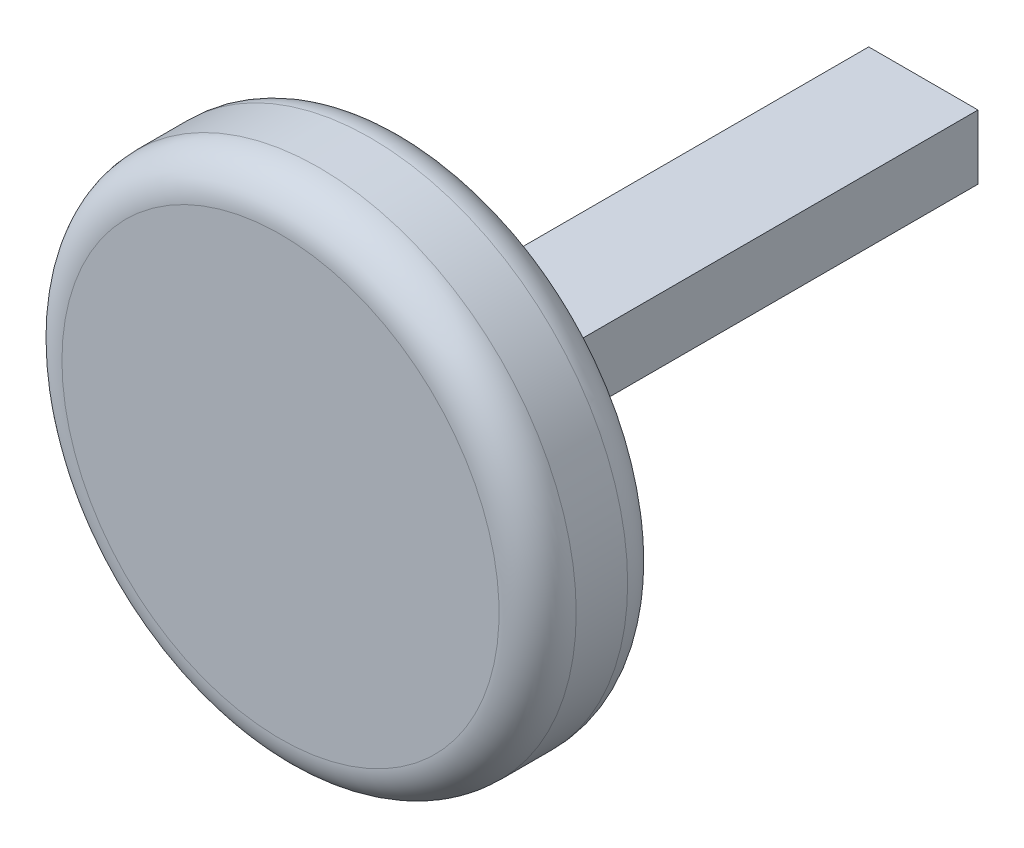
ISO-10303-21;
HEADER;
FILE_DESCRIPTION(('STEP AP214'),'2;1');
FILE_NAME('part.step','',(''),(''),'','','');
FILE_SCHEMA(('AUTOMOTIVE_DESIGN { 1 0 10303 214 1 1 1 1 }'));
ENDSEC;
DATA;
#1=APPLICATION_CONTEXT('core data for automotive mechanical design processes');
#2=APPLICATION_PROTOCOL_DEFINITION('international standard','automotive_design',2000,#1);
#3=PRODUCT_CONTEXT('',#1,'mechanical');
#4=PRODUCT('Part','Part','',(#3));
#5=PRODUCT_RELATED_PRODUCT_CATEGORY('part','',(#4));
#6=PRODUCT_DEFINITION_FORMATION('','',#4);
#7=PRODUCT_DEFINITION_CONTEXT('part definition',#1,'design');
#8=PRODUCT_DEFINITION('design','',#6,#7);
#9=PRODUCT_DEFINITION_SHAPE('','',#8);
#10=(LENGTH_UNIT() NAMED_UNIT(*) SI_UNIT(.MILLI.,.METRE.));
#11=(NAMED_UNIT(*) PLANE_ANGLE_UNIT() SI_UNIT($,.RADIAN.));
#12=(NAMED_UNIT(*) SI_UNIT($,.STERADIAN.) SOLID_ANGLE_UNIT());
#13=UNCERTAINTY_MEASURE_WITH_UNIT(LENGTH_MEASURE(1.E-05),#10,'distance_accuracy_value','');
#14=(GEOMETRIC_REPRESENTATION_CONTEXT(3) GLOBAL_UNCERTAINTY_ASSIGNED_CONTEXT((#13)) GLOBAL_UNIT_ASSIGNED_CONTEXT((#10,
#11,#12)) REPRESENTATION_CONTEXT('',''));
#15=CARTESIAN_POINT('',(0.,0.,0.));
#16=DIRECTION('',(0.,0.,1.));
#17=DIRECTION('',(1.,0.,0.));
#18=AXIS2_PLACEMENT_3D('',#15,#16,#17);
#19=CARTESIAN_POINT('',(-8.5,-5.,100.));
#20=DIRECTION('',(1.,0.,0.));
#21=DIRECTION('',(0.,0.,-1.));
#22=AXIS2_PLACEMENT_3D('',#19,#20,#21);
#23=PLANE('',#22);
#24=DIRECTION('',(0.,-1.,0.));
#25=VECTOR('',#24,1.);
#26=CARTESIAN_POINT('',(-8.5,-5.,80.));
#27=LINE('',#26,#25);
#28=CARTESIAN_POINT('',(-8.5,5.,80.));
#29=VERTEX_POINT('',#28);
#30=CARTESIAN_POINT('',(-8.5,-5.,80.));
#31=VERTEX_POINT('',#30);
#32=EDGE_CURVE('E92',#29,#31,#27,.T.);
#33=ORIENTED_EDGE('',*,*,#32,.F.);
#34=DIRECTION('',(0.,0.,-1.));
#35=VECTOR('',#34,1.);
#36=CARTESIAN_POINT('',(-8.5,5.,100.));
#37=LINE('',#36,#35);
#38=CARTESIAN_POINT('',(-8.5,5.,0.));
#39=VERTEX_POINT('',#38);
#40=EDGE_CURVE('E81',#29,#39,#37,.T.);
#41=ORIENTED_EDGE('',*,*,#40,.T.);
#42=DIRECTION('',(0.,-1.,0.));
#43=VECTOR('',#42,1.);
#44=CARTESIAN_POINT('',(-8.5,-5.,0.));
#45=LINE('',#44,#43);
#46=CARTESIAN_POINT('',(-8.5,-5.,0.));
#47=VERTEX_POINT('',#46);
#48=EDGE_CURVE('E94',#39,#47,#45,.T.);
#49=ORIENTED_EDGE('',*,*,#48,.T.);
#50=DIRECTION('',(0.,0.,-1.));
#51=VECTOR('',#50,1.);
#52=CARTESIAN_POINT('',(-8.5,-5.,100.));
#53=LINE('',#52,#51);
#54=EDGE_CURVE('E48',#31,#47,#53,.T.);
#55=ORIENTED_EDGE('',*,*,#54,.F.);
#56=EDGE_LOOP('',(#33,#41,#49,#55));
#57=FACE_BOUND('',#56,.T.);
#58=ADVANCED_FACE('F41',(#57),#23,.F.);
#59=CARTESIAN_POINT('',(-8.5,-5.,100.));
#60=DIRECTION('',(0.,1.,0.));
#61=DIRECTION('',(0.,0.,1.));
#62=AXIS2_PLACEMENT_3D('',#59,#60,#61);
#63=PLANE('',#62);
#64=DIRECTION('',(1.,0.,0.));
#65=VECTOR('',#64,1.);
#66=CARTESIAN_POINT('',(-8.5,-5.,80.));
#67=LINE('',#66,#65);
#68=CARTESIAN_POINT('',(8.5,-5.,80.));
#69=VERTEX_POINT('',#68);
#70=EDGE_CURVE('E55',#31,#69,#67,.T.);
#71=ORIENTED_EDGE('',*,*,#70,.F.);
#72=ORIENTED_EDGE('',*,*,#54,.T.);
#73=DIRECTION('',(1.,0.,0.));
#74=VECTOR('',#73,1.);
#75=CARTESIAN_POINT('',(-8.5,-5.,0.));
#76=LINE('',#75,#74);
#77=CARTESIAN_POINT('',(8.5,-5.,0.));
#78=VERTEX_POINT('',#77);
#79=EDGE_CURVE('E106',#47,#78,#76,.T.);
#80=ORIENTED_EDGE('',*,*,#79,.T.);
#81=DIRECTION('',(0.,0.,-1.));
#82=VECTOR('',#81,1.);
#83=CARTESIAN_POINT('',(8.5,-5.,100.));
#84=LINE('',#83,#82);
#85=EDGE_CURVE('E114',#69,#78,#84,.T.);
#86=ORIENTED_EDGE('',*,*,#85,.F.);
#87=EDGE_LOOP('',(#71,#72,#80,#86));
#88=FACE_BOUND('',#87,.T.);
#89=ADVANCED_FACE('F116',(#88),#63,.F.);
#90=CARTESIAN_POINT('',(8.5,-5.,100.));
#91=DIRECTION('',(-1.,0.,0.));
#92=DIRECTION('',(0.,0.,1.));
#93=AXIS2_PLACEMENT_3D('',#90,#91,#92);
#94=PLANE('',#93);
#95=DIRECTION('',(0.,1.,0.));
#96=VECTOR('',#95,1.);
#97=CARTESIAN_POINT('',(8.5,-5.,80.));
#98=LINE('',#97,#96);
#99=CARTESIAN_POINT('',(8.5,5.,80.));
#100=VERTEX_POINT('',#99);
#101=EDGE_CURVE('E63',#69,#100,#98,.T.);
#102=ORIENTED_EDGE('',*,*,#101,.F.);
#103=ORIENTED_EDGE('',*,*,#85,.T.);
#104=DIRECTION('',(0.,1.,0.));
#105=VECTOR('',#104,1.);
#106=CARTESIAN_POINT('',(8.5,-5.,0.));
#107=LINE('',#106,#105);
#108=CARTESIAN_POINT('',(8.5,5.,0.));
#109=VERTEX_POINT('',#108);
#110=EDGE_CURVE('E109',#78,#109,#107,.T.);
#111=ORIENTED_EDGE('',*,*,#110,.T.);
#112=DIRECTION('',(0.,0.,-1.));
#113=VECTOR('',#112,1.);
#114=CARTESIAN_POINT('',(8.5,5.,100.));
#115=LINE('',#114,#113);
#116=EDGE_CURVE('E89',#100,#109,#115,.T.);
#117=ORIENTED_EDGE('',*,*,#116,.F.);
#118=EDGE_LOOP('',(#102,#103,#111,#117));
#119=FACE_BOUND('',#118,.T.);
#120=ADVANCED_FACE('F120',(#119),#94,.F.);
#121=CARTESIAN_POINT('',(-8.5,5.,100.));
#122=DIRECTION('',(0.,-1.,0.));
#123=DIRECTION('',(0.,0.,-1.));
#124=AXIS2_PLACEMENT_3D('',#121,#122,#123);
#125=PLANE('',#124);
#126=DIRECTION('',(-1.,0.,0.));
#127=VECTOR('',#126,1.);
#128=CARTESIAN_POINT('',(-8.5,5.,80.));
#129=LINE('',#128,#127);
#130=EDGE_CURVE('E12',#100,#29,#129,.T.);
#131=ORIENTED_EDGE('',*,*,#130,.F.);
#132=ORIENTED_EDGE('',*,*,#116,.T.);
#133=DIRECTION('',(-1.,0.,0.));
#134=VECTOR('',#133,1.);
#135=CARTESIAN_POINT('',(-8.5,5.,0.));
#136=LINE('',#135,#134);
#137=EDGE_CURVE('E85',#109,#39,#136,.T.);
#138=ORIENTED_EDGE('',*,*,#137,.T.);
#139=ORIENTED_EDGE('',*,*,#40,.F.);
#140=EDGE_LOOP('',(#131,#132,#138,#139));
#141=FACE_BOUND('',#140,.T.);
#142=ADVANCED_FACE('F83',(#141),#125,.F.);
#143=CARTESIAN_POINT('',(-8.5,5.,0.));
#144=DIRECTION('',(0.,0.,-1.));
#145=DIRECTION('',(-1.,0.,0.));
#146=AXIS2_PLACEMENT_3D('',#143,#144,#145);
#147=PLANE('',#146);
#148=ORIENTED_EDGE('',*,*,#48,.F.);
#149=ORIENTED_EDGE('',*,*,#137,.F.);
#150=ORIENTED_EDGE('',*,*,#110,.F.);
#151=ORIENTED_EDGE('',*,*,#79,.F.);
#152=EDGE_LOOP('',(#148,#149,#150,#151));
#153=FACE_BOUND('',#152,.T.);
#154=ADVANCED_FACE('F119',(#153),#147,.T.);
#155=CARTESIAN_POINT('',(0.,0.,80.));
#156=DIRECTION('',(0.,0.,1.));
#157=DIRECTION('',(1.,0.,0.));
#158=AXIS2_PLACEMENT_3D('',#155,#156,#157);
#159=PLANE('',#158);
#160=CARTESIAN_POINT('',(0.,0.,80.));
#161=DIRECTION('',(0.,0.,-1.));
#162=DIRECTION('',(-1.,0.,0.));
#163=AXIS2_PLACEMENT_3D('',#160,#161,#162);
#164=CIRCLE('',#163,34.);
#165=CARTESIAN_POINT('',(-34.,0.,80.));
#166=VERTEX_POINT('',#165);
#167=EDGE_CURVE('E97',#166,#166,#164,.T.);
#168=ORIENTED_EDGE('',*,*,#167,.T.);
#169=EDGE_LOOP('',(#168));
#170=FACE_BOUND('',#169,.T.);
#171=ORIENTED_EDGE('',*,*,#130,.T.);
#172=ORIENTED_EDGE('',*,*,#32,.T.);
#173=ORIENTED_EDGE('',*,*,#70,.T.);
#174=ORIENTED_EDGE('',*,*,#101,.T.);
#175=EDGE_LOOP('',(#171,#172,#173,#174));
#176=FACE_BOUND('',#175,.T.);
#177=ADVANCED_FACE('F96',(#170,#176),#159,.F.);
#178=CARTESIAN_POINT('',(0.,0.,86.));
#179=DIRECTION('',(0.,0.,-1.));
#180=DIRECTION('',(-1.,0.,0.));
#181=AXIS2_PLACEMENT_3D('',#178,#179,#180);
#182=TOROIDAL_SURFACE('',#181,34.,6.);
#183=ORIENTED_EDGE('',*,*,#167,.F.);
#184=EDGE_LOOP('',(#183));
#185=FACE_BOUND('',#184,.T.);
#186=CARTESIAN_POINT('',(0.,0.,86.));
#187=DIRECTION('',(0.,0.,-1.));
#188=DIRECTION('',(-1.,0.,0.));
#189=AXIS2_PLACEMENT_3D('',#186,#187,#188);
#190=CIRCLE('',#189,40.);
#191=CARTESIAN_POINT('',(-40.,0.,86.));
#192=VERTEX_POINT('',#191);
#193=EDGE_CURVE('E101',#192,#192,#190,.T.);
#194=ORIENTED_EDGE('',*,*,#193,.T.);
#195=EDGE_LOOP('',(#194));
#196=FACE_BOUND('',#195,.T.);
#197=ADVANCED_FACE('F157',(#185,#196),#182,.T.);
#198=CARTESIAN_POINT('',(0.,0.,80.));
#199=DIRECTION('',(0.,0.,-1.));
#200=DIRECTION('',(-1.,0.,0.));
#201=AXIS2_PLACEMENT_3D('',#198,#199,#200);
#202=CYLINDRICAL_SURFACE('',#201,40.);
#203=ORIENTED_EDGE('',*,*,#193,.F.);
#204=EDGE_LOOP('',(#203));
#205=FACE_BOUND('',#204,.T.);
#206=CARTESIAN_POINT('',(0.,0.,94.));
#207=DIRECTION('',(0.,0.,-1.));
#208=DIRECTION('',(-1.,0.,0.));
#209=AXIS2_PLACEMENT_3D('',#206,#207,#208);
#210=CIRCLE('',#209,40.);
#211=CARTESIAN_POINT('',(-40.,0.,94.));
#212=VERTEX_POINT('',#211);
#213=EDGE_CURVE('E214',#212,#212,#210,.T.);
#214=ORIENTED_EDGE('',*,*,#213,.T.);
#215=EDGE_LOOP('',(#214));
#216=FACE_BOUND('',#215,.T.);
#217=ADVANCED_FACE('F167',(#205,#216),#202,.T.);
#218=CARTESIAN_POINT('',(0.,0.,94.));
#219=DIRECTION('',(0.,0.,-1.));
#220=DIRECTION('',(-1.,0.,0.));
#221=AXIS2_PLACEMENT_3D('',#218,#219,#220);
#222=TOROIDAL_SURFACE('',#221,34.,6.);
#223=ORIENTED_EDGE('',*,*,#213,.F.);
#224=EDGE_LOOP('',(#223));
#225=FACE_BOUND('',#224,.T.);
#226=CARTESIAN_POINT('',(0.,0.,100.));
#227=DIRECTION('',(0.,0.,-1.));
#228=DIRECTION('',(-1.,0.,0.));
#229=AXIS2_PLACEMENT_3D('',#226,#227,#228);
#230=CIRCLE('',#229,34.);
#231=CARTESIAN_POINT('',(-34.,0.,100.));
#232=VERTEX_POINT('',#231);
#233=EDGE_CURVE('E211',#232,#232,#230,.T.);
#234=ORIENTED_EDGE('',*,*,#233,.T.);
#235=EDGE_LOOP('',(#234));
#236=FACE_BOUND('',#235,.T.);
#237=ADVANCED_FACE('F177',(#225,#236),#222,.T.);
#238=CARTESIAN_POINT('',(-8.5,5.,100.));
#239=DIRECTION('',(0.,0.,-1.));
#240=DIRECTION('',(-1.,0.,0.));
#241=AXIS2_PLACEMENT_3D('',#238,#239,#240);
#242=PLANE('',#241);
#243=ORIENTED_EDGE('',*,*,#233,.F.);
#244=EDGE_LOOP('',(#243));
#245=FACE_BOUND('',#244,.T.);
#246=ADVANCED_FACE('F187',(#245),#242,.F.);
#247=CLOSED_SHELL('',(#58,#89,#120,#142,#154,#177,#197,#217,#237,#246));
#248=MANIFOLD_SOLID_BREP('B2',#247);
#249=ADVANCED_BREP_SHAPE_REPRESENTATION('',(#18,#248),#14);
#250=SHAPE_DEFINITION_REPRESENTATION(#9,#249);
ENDSEC;
END-ISO-10303-21;
